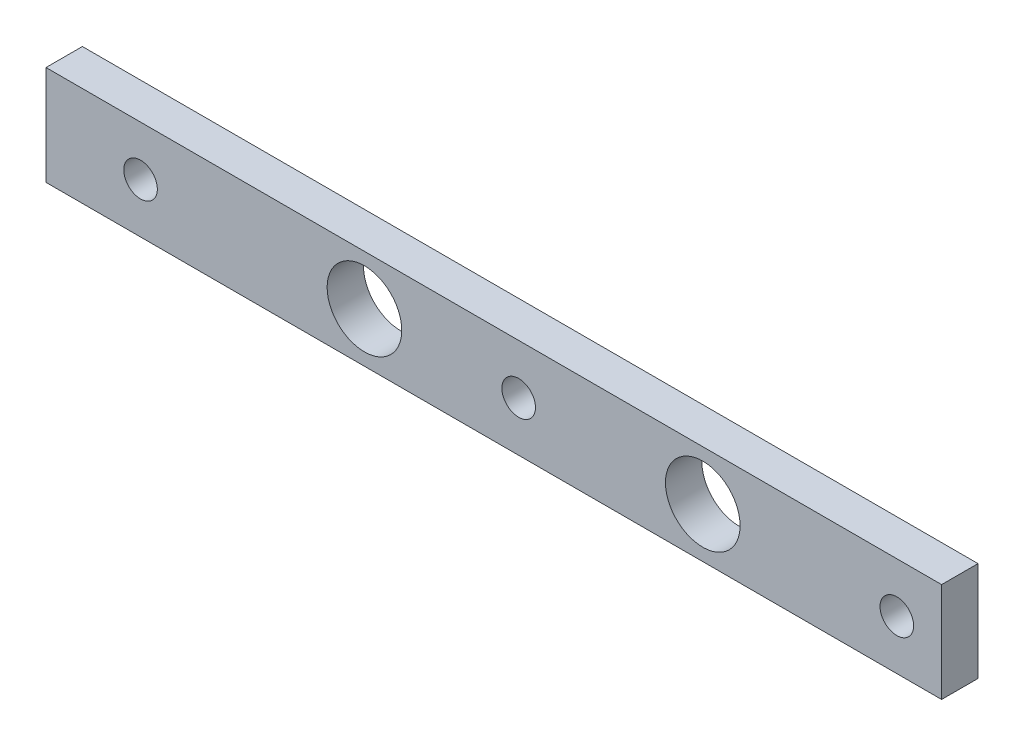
from build123d import *

# Parameters (mm, degrees)
SKETCH1_W           = 285.75
SKETCH1_H           = 31.75
BOSS_EXTRUDE1_DEPTH = 11.6082064
HOLE1_D             = 7.1374
HOLE1_CBORE_D       = 10.7188
HOLE1_CBORE_DEPTH   = 7.874
HOLE11_D            = 23.8125


with BuildPart() as part:
    # Sketch1 → Boss-Extrude1 (new body)
    with BuildSketch(Plane.XY):
        with Locations((-598.17, 41.275)):
            Rectangle(SKETCH1_W, SKETCH1_H)
    extrude(amount=BOSS_EXTRUDE1_DEPTH)

    # Hole1 (through all)
    with Locations(Plane(origin=(-721.239412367, 42.209999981, 11.6082064), x_dir=(1, 0, 0), z_dir=(0, 0, 1))):
        with Locations((10.356912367, -0.934999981), (251.656912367, -0.934999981), (131.006912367, -0.934999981)):
            CounterBoreHole(HOLE1_D / 2, HOLE1_CBORE_D / 2, HOLE1_CBORE_DEPTH)

    # Hole11 (through all)
    with Locations(Plane(origin=(-477.040739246, 102.676140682, 0), x_dir=(-1, 0, 0), z_dir=(0, 0, -1))):
        with Locations((162.404260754, -61.401140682), (54.454260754, -61.401140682)):
            Hole(HOLE11_D / 2)


solid = part.part
